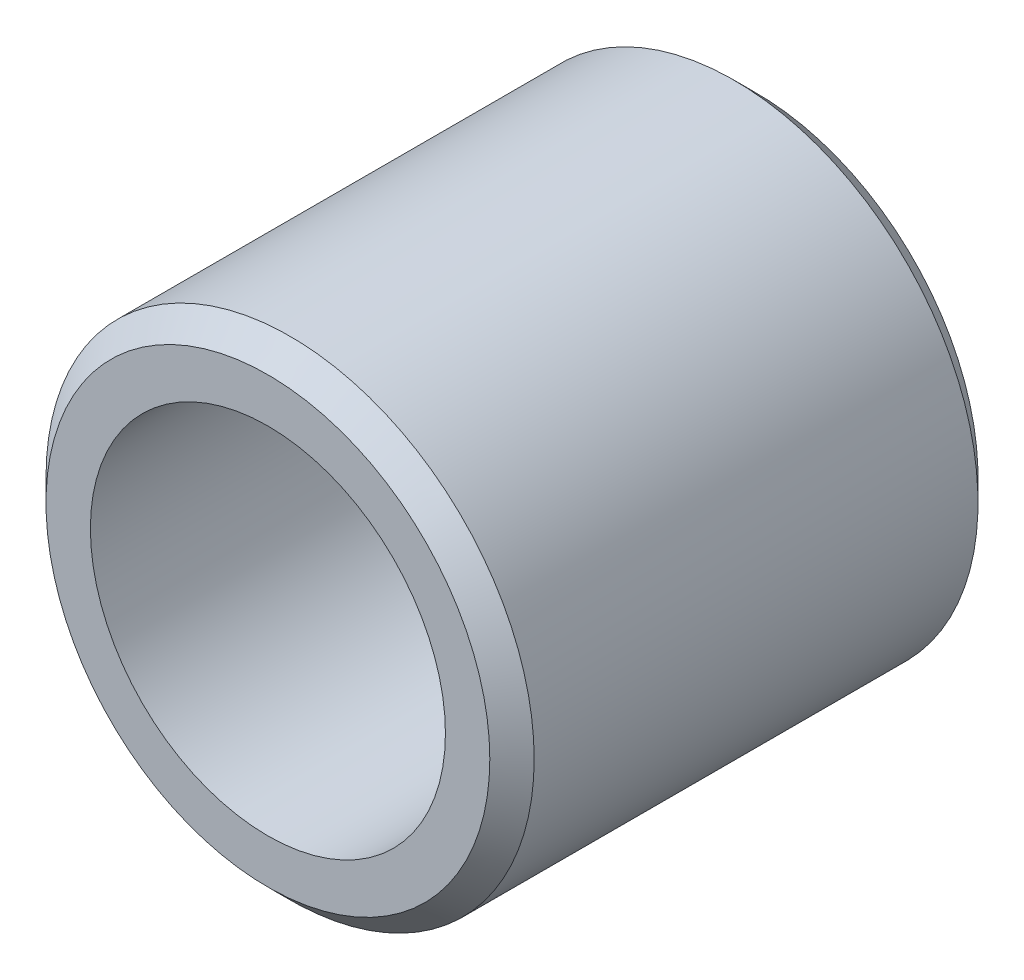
ISO-10303-21;
HEADER;
FILE_DESCRIPTION(('STEP AP214'),'2;1');
FILE_NAME('part.step','',(''),(''),'','','');
FILE_SCHEMA(('AUTOMOTIVE_DESIGN { 1 0 10303 214 1 1 1 1 }'));
ENDSEC;
DATA;
#1=APPLICATION_CONTEXT('core data for automotive mechanical design processes');
#2=APPLICATION_PROTOCOL_DEFINITION('international standard','automotive_design',2000,#1);
#3=PRODUCT_CONTEXT('',#1,'mechanical');
#4=PRODUCT('Part','Part','',(#3));
#5=PRODUCT_RELATED_PRODUCT_CATEGORY('part','',(#4));
#6=PRODUCT_DEFINITION_FORMATION('','',#4);
#7=PRODUCT_DEFINITION_CONTEXT('part definition',#1,'design');
#8=PRODUCT_DEFINITION('design','',#6,#7);
#9=PRODUCT_DEFINITION_SHAPE('','',#8);
#10=(LENGTH_UNIT() NAMED_UNIT(*) SI_UNIT(.MILLI.,.METRE.));
#11=(NAMED_UNIT(*) PLANE_ANGLE_UNIT() SI_UNIT($,.RADIAN.));
#12=(NAMED_UNIT(*) SI_UNIT($,.STERADIAN.) SOLID_ANGLE_UNIT());
#13=UNCERTAINTY_MEASURE_WITH_UNIT(LENGTH_MEASURE(1.E-05),#10,'distance_accuracy_value','');
#14=(GEOMETRIC_REPRESENTATION_CONTEXT(3) GLOBAL_UNCERTAINTY_ASSIGNED_CONTEXT((#13)) GLOBAL_UNIT_ASSIGNED_CONTEXT((#10,
#11,#12)) REPRESENTATION_CONTEXT('',''));
#15=CARTESIAN_POINT('',(0.,0.,0.));
#16=DIRECTION('',(0.,0.,1.));
#17=DIRECTION('',(1.,0.,0.));
#18=AXIS2_PLACEMENT_3D('',#15,#16,#17);
#19=CARTESIAN_POINT('',(0.,0.,0.));
#20=DIRECTION('',(0.,0.,-1.));
#21=DIRECTION('',(-1.,0.,0.));
#22=AXIS2_PLACEMENT_3D('',#19,#20,#21);
#23=CYLINDRICAL_SURFACE('',#22,8.);
#24=CARTESIAN_POINT('',(0.,0.,0.));
#25=DIRECTION('',(0.,0.,-1.));
#26=DIRECTION('',(-1.,0.,0.));
#27=AXIS2_PLACEMENT_3D('',#24,#25,#26);
#28=CIRCLE('',#27,8.);
#29=CARTESIAN_POINT('',(-8.,0.,0.));
#30=VERTEX_POINT('',#29);
#31=EDGE_CURVE('E34',#30,#30,#28,.T.);
#32=ORIENTED_EDGE('',*,*,#31,.T.);
#33=EDGE_LOOP('',(#32));
#34=FACE_BOUND('',#33,.T.);
#35=CARTESIAN_POINT('',(0.,0.,22.));
#36=DIRECTION('',(0.,0.,-1.));
#37=DIRECTION('',(-1.,0.,0.));
#38=AXIS2_PLACEMENT_3D('',#35,#36,#37);
#39=CIRCLE('',#38,8.);
#40=CARTESIAN_POINT('',(-8.,0.,22.));
#41=VERTEX_POINT('',#40);
#42=EDGE_CURVE('E31',#41,#41,#39,.T.);
#43=ORIENTED_EDGE('',*,*,#42,.F.);
#44=EDGE_LOOP('',(#43));
#45=FACE_BOUND('',#44,.T.);
#46=ADVANCED_FACE('F12',(#34,#45),#23,.F.);
#47=CARTESIAN_POINT('',(-8.,0.,22.));
#48=DIRECTION('',(0.,0.,1.));
#49=DIRECTION('',(1.,0.,0.));
#50=AXIS2_PLACEMENT_3D('',#47,#48,#49);
#51=PLANE('',#50);
#52=CARTESIAN_POINT('',(0.,0.,22.));
#53=DIRECTION('',(0.,0.,1.));
#54=DIRECTION('',(1.,0.,0.));
#55=AXIS2_PLACEMENT_3D('',#52,#53,#54);
#56=CIRCLE('',#55,10.);
#57=CARTESIAN_POINT('',(10.,0.,22.));
#58=VERTEX_POINT('',#57);
#59=EDGE_CURVE('E8',#58,#58,#56,.T.);
#60=ORIENTED_EDGE('',*,*,#59,.T.);
#61=EDGE_LOOP('',(#60));
#62=FACE_BOUND('',#61,.T.);
#63=ORIENTED_EDGE('',*,*,#42,.T.);
#64=EDGE_LOOP('',(#63));
#65=FACE_BOUND('',#64,.T.);
#66=ADVANCED_FACE('F55',(#62,#65),#51,.T.);
#67=CARTESIAN_POINT('',(0.,0.,0.));
#68=DIRECTION('',(0.,0.,-1.));
#69=DIRECTION('',(-1.,0.,0.));
#70=AXIS2_PLACEMENT_3D('',#67,#68,#69);
#71=CYLINDRICAL_SURFACE('',#70,11.);
#72=CARTESIAN_POINT('',(0.,0.,0.999999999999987));
#73=DIRECTION('',(0.,0.,-1.));
#74=DIRECTION('',(-1.,0.,0.));
#75=AXIS2_PLACEMENT_3D('',#72,#73,#74);
#76=CIRCLE('',#75,11.);
#77=CARTESIAN_POINT('',(-11.,0.,0.999999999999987));
#78=VERTEX_POINT('',#77);
#79=EDGE_CURVE('E18',#78,#78,#76,.F.);
#80=ORIENTED_EDGE('',*,*,#79,.T.);
#81=EDGE_LOOP('',(#80));
#82=FACE_BOUND('',#81,.T.);
#83=CARTESIAN_POINT('',(0.,0.,21.));
#84=DIRECTION('',(0.,0.,1.));
#85=DIRECTION('',(1.,0.,0.));
#86=AXIS2_PLACEMENT_3D('',#83,#84,#85);
#87=CIRCLE('',#86,11.);
#88=CARTESIAN_POINT('',(11.,0.,21.));
#89=VERTEX_POINT('',#88);
#90=EDGE_CURVE('E22',#89,#89,#87,.F.);
#91=ORIENTED_EDGE('',*,*,#90,.T.);
#92=EDGE_LOOP('',(#91));
#93=FACE_BOUND('',#92,.T.);
#94=ADVANCED_FACE('F43',(#82,#93),#71,.T.);
#95=CARTESIAN_POINT('',(-8.,0.,0.));
#96=DIRECTION('',(0.,0.,-1.));
#97=DIRECTION('',(-1.,0.,0.));
#98=AXIS2_PLACEMENT_3D('',#95,#96,#97);
#99=PLANE('',#98);
#100=CARTESIAN_POINT('',(0.,0.,0.));
#101=DIRECTION('',(0.,0.,-1.));
#102=DIRECTION('',(-1.,0.,0.));
#103=AXIS2_PLACEMENT_3D('',#100,#101,#102);
#104=CIRCLE('',#103,10.);
#105=CARTESIAN_POINT('',(-10.,0.,0.));
#106=VERTEX_POINT('',#105);
#107=EDGE_CURVE('E26',#106,#106,#104,.T.);
#108=ORIENTED_EDGE('',*,*,#107,.T.);
#109=EDGE_LOOP('',(#108));
#110=FACE_BOUND('',#109,.T.);
#111=ORIENTED_EDGE('',*,*,#31,.F.);
#112=EDGE_LOOP('',(#111));
#113=FACE_BOUND('',#112,.T.);
#114=ADVANCED_FACE('F40',(#110,#113),#99,.T.);
#115=CARTESIAN_POINT('',(0.,0.,0.));
#116=DIRECTION('',(0.,0.,1.));
#117=DIRECTION('',(1.,0.,0.));
#118=AXIS2_PLACEMENT_3D('',#115,#116,#117);
#119=CONICAL_SURFACE('',#118,10.,0.785398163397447);
#120=ORIENTED_EDGE('',*,*,#79,.F.);
#121=EDGE_LOOP('',(#120));
#122=FACE_BOUND('',#121,.T.);
#123=ORIENTED_EDGE('',*,*,#107,.F.);
#124=EDGE_LOOP('',(#123));
#125=FACE_BOUND('',#124,.T.);
#126=ADVANCED_FACE('F42',(#122,#125),#119,.T.);
#127=CARTESIAN_POINT('',(0.,0.,21.));
#128=DIRECTION('',(0.,0.,-1.));
#129=DIRECTION('',(-1.,0.,0.));
#130=AXIS2_PLACEMENT_3D('',#127,#128,#129);
#131=CONICAL_SURFACE('',#130,11.,0.78539816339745);
#132=ORIENTED_EDGE('',*,*,#59,.F.);
#133=EDGE_LOOP('',(#132));
#134=FACE_BOUND('',#133,.T.);
#135=ORIENTED_EDGE('',*,*,#90,.F.);
#136=EDGE_LOOP('',(#135));
#137=FACE_BOUND('',#136,.T.);
#138=ADVANCED_FACE('F52',(#134,#137),#131,.T.);
#139=CLOSED_SHELL('',(#46,#66,#94,#114,#126,#138));
#140=MANIFOLD_SOLID_BREP('B1',#139);
#141=ADVANCED_BREP_SHAPE_REPRESENTATION('',(#18,#140),#14);
#142=SHAPE_DEFINITION_REPRESENTATION(#9,#141);
ENDSEC;
END-ISO-10303-21;
